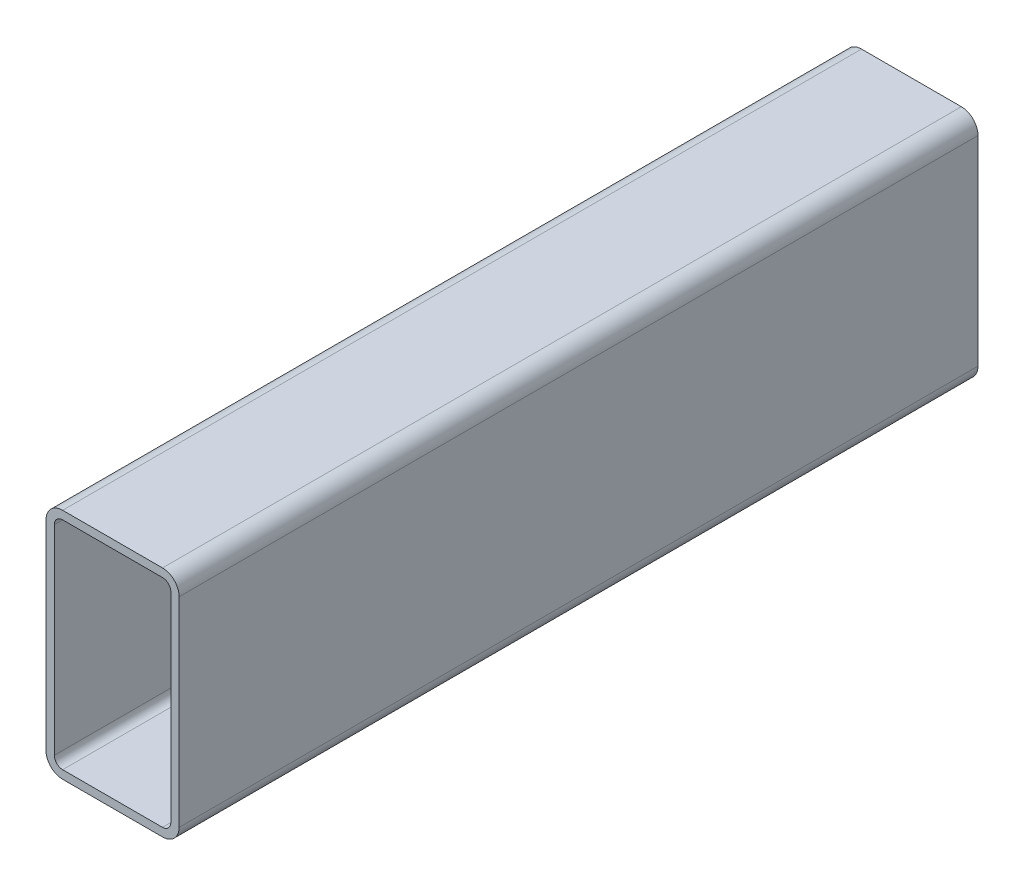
ISO-10303-21;
HEADER;
FILE_DESCRIPTION(('STEP AP214'),'2;1');
FILE_NAME('part.step','',(''),(''),'','','');
FILE_SCHEMA(('AUTOMOTIVE_DESIGN { 1 0 10303 214 1 1 1 1 }'));
ENDSEC;
DATA;
#1=APPLICATION_CONTEXT('core data for automotive mechanical design processes');
#2=APPLICATION_PROTOCOL_DEFINITION('international standard','automotive_design',2000,#1);
#3=PRODUCT_CONTEXT('',#1,'mechanical');
#4=PRODUCT('Part','Part','',(#3));
#5=PRODUCT_RELATED_PRODUCT_CATEGORY('part','',(#4));
#6=PRODUCT_DEFINITION_FORMATION('','',#4);
#7=PRODUCT_DEFINITION_CONTEXT('part definition',#1,'design');
#8=PRODUCT_DEFINITION('design','',#6,#7);
#9=PRODUCT_DEFINITION_SHAPE('','',#8);
#10=(LENGTH_UNIT() NAMED_UNIT(*) SI_UNIT(.MILLI.,.METRE.));
#11=(NAMED_UNIT(*) PLANE_ANGLE_UNIT() SI_UNIT($,.RADIAN.));
#12=(NAMED_UNIT(*) SI_UNIT($,.STERADIAN.) SOLID_ANGLE_UNIT());
#13=UNCERTAINTY_MEASURE_WITH_UNIT(LENGTH_MEASURE(1.E-05),#10,'distance_accuracy_value','');
#14=(GEOMETRIC_REPRESENTATION_CONTEXT(3) GLOBAL_UNCERTAINTY_ASSIGNED_CONTEXT((#13)) GLOBAL_UNIT_ASSIGNED_CONTEXT((#10,
#11,#12)) REPRESENTATION_CONTEXT('',''));
#15=CARTESIAN_POINT('',(0.,0.,0.));
#16=DIRECTION('',(0.,0.,1.));
#17=DIRECTION('',(1.,0.,0.));
#18=AXIS2_PLACEMENT_3D('',#15,#16,#17);
#19=CARTESIAN_POINT('',(6.35,82.55,304.8));
#20=DIRECTION('',(0.,0.,1.));
#21=DIRECTION('',(1.,0.,0.));
#22=AXIS2_PLACEMENT_3D('',#19,#20,#21);
#23=PLANE('',#22);
#24=CARTESIAN_POINT('',(6.35,82.55,304.8));
#25=DIRECTION('',(0.,0.,1.));
#26=DIRECTION('',(1.,0.,0.));
#27=AXIS2_PLACEMENT_3D('',#24,#25,#26);
#28=CIRCLE('',#27,6.35);
#29=CARTESIAN_POINT('',(6.35,88.9,304.8));
#30=VERTEX_POINT('',#29);
#31=CARTESIAN_POINT('',(0.,82.55,304.8));
#32=VERTEX_POINT('',#31);
#33=EDGE_CURVE('E211',#30,#32,#28,.T.);
#34=ORIENTED_EDGE('',*,*,#33,.T.);
#35=DIRECTION('',(0.,-1.,0.));
#36=VECTOR('',#35,1.);
#37=CARTESIAN_POINT('',(0.,6.35,304.8));
#38=LINE('',#37,#36);
#39=CARTESIAN_POINT('',(0.,6.35,304.8));
#40=VERTEX_POINT('',#39);
#41=EDGE_CURVE('E214',#32,#40,#38,.T.);
#42=ORIENTED_EDGE('',*,*,#41,.T.);
#43=CARTESIAN_POINT('',(6.35,6.35,304.8));
#44=DIRECTION('',(0.,0.,1.));
#45=DIRECTION('',(1.,0.,0.));
#46=AXIS2_PLACEMENT_3D('',#43,#44,#45);
#47=CIRCLE('',#46,6.35);
#48=CARTESIAN_POINT('',(6.35,0.,304.8));
#49=VERTEX_POINT('',#48);
#50=EDGE_CURVE('E217',#40,#49,#47,.T.);
#51=ORIENTED_EDGE('',*,*,#50,.T.);
#52=DIRECTION('',(1.,0.,0.));
#53=VECTOR('',#52,1.);
#54=CARTESIAN_POINT('',(44.45,0.,304.8));
#55=LINE('',#54,#53);
#56=CARTESIAN_POINT('',(44.45,0.,304.8));
#57=VERTEX_POINT('',#56);
#58=EDGE_CURVE('E219',#49,#57,#55,.T.);
#59=ORIENTED_EDGE('',*,*,#58,.T.);
#60=CARTESIAN_POINT('',(44.45,6.35,304.8));
#61=DIRECTION('',(0.,0.,1.));
#62=DIRECTION('',(1.,0.,0.));
#63=AXIS2_PLACEMENT_3D('',#60,#61,#62);
#64=CIRCLE('',#63,6.35);
#65=CARTESIAN_POINT('',(50.8,6.35,304.8));
#66=VERTEX_POINT('',#65);
#67=EDGE_CURVE('E221',#57,#66,#64,.T.);
#68=ORIENTED_EDGE('',*,*,#67,.T.);
#69=DIRECTION('',(0.,1.,0.));
#70=VECTOR('',#69,1.);
#71=CARTESIAN_POINT('',(50.8,82.55,304.8));
#72=LINE('',#71,#70);
#73=CARTESIAN_POINT('',(50.8,82.55,304.8));
#74=VERTEX_POINT('',#73);
#75=EDGE_CURVE('E223',#66,#74,#72,.T.);
#76=ORIENTED_EDGE('',*,*,#75,.T.);
#77=CARTESIAN_POINT('',(44.45,82.55,304.8));
#78=DIRECTION('',(0.,0.,1.));
#79=DIRECTION('',(1.,0.,0.));
#80=AXIS2_PLACEMENT_3D('',#77,#78,#79);
#81=CIRCLE('',#80,6.35);
#82=CARTESIAN_POINT('',(44.45,88.9,304.8));
#83=VERTEX_POINT('',#82);
#84=EDGE_CURVE('E225',#74,#83,#81,.T.);
#85=ORIENTED_EDGE('',*,*,#84,.T.);
#86=DIRECTION('',(-1.,0.,0.));
#87=VECTOR('',#86,1.);
#88=CARTESIAN_POINT('',(6.35,88.9,304.8));
#89=LINE('',#88,#87);
#90=EDGE_CURVE('E227',#83,#30,#89,.T.);
#91=ORIENTED_EDGE('',*,*,#90,.T.);
#92=EDGE_LOOP('',(#34,#42,#51,#59,#68,#76,#85,#91));
#93=FACE_BOUND('',#92,.T.);
#94=DIRECTION('',(0.,-1.,0.));
#95=VECTOR('',#94,1.);
#96=CARTESIAN_POINT('',(3.175,6.35,304.8));
#97=LINE('',#96,#95);
#98=CARTESIAN_POINT('',(3.175,82.55,304.8));
#99=VERTEX_POINT('',#98);
#100=CARTESIAN_POINT('',(3.175,6.35,304.8));
#101=VERTEX_POINT('',#100);
#102=EDGE_CURVE('E154',#99,#101,#97,.T.);
#103=ORIENTED_EDGE('',*,*,#102,.F.);
#104=CARTESIAN_POINT('',(6.35,82.55,304.8));
#105=DIRECTION('',(0.,0.,1.));
#106=DIRECTION('',(1.,0.,0.));
#107=AXIS2_PLACEMENT_3D('',#104,#105,#106);
#108=CIRCLE('',#107,3.175);
#109=CARTESIAN_POINT('',(6.35,85.725,304.8));
#110=VERTEX_POINT('',#109);
#111=EDGE_CURVE('E146',#110,#99,#108,.T.);
#112=ORIENTED_EDGE('',*,*,#111,.F.);
#113=DIRECTION('',(-1.,0.,0.));
#114=VECTOR('',#113,1.);
#115=CARTESIAN_POINT('',(6.35,85.725,304.8));
#116=LINE('',#115,#114);
#117=CARTESIAN_POINT('',(44.45,85.725,304.8));
#118=VERTEX_POINT('',#117);
#119=EDGE_CURVE('E179',#118,#110,#116,.T.);
#120=ORIENTED_EDGE('',*,*,#119,.F.);
#121=CARTESIAN_POINT('',(44.45,82.55,304.8));
#122=DIRECTION('',(0.,0.,1.));
#123=DIRECTION('',(1.,0.,0.));
#124=AXIS2_PLACEMENT_3D('',#121,#122,#123);
#125=CIRCLE('',#124,3.175);
#126=CARTESIAN_POINT('',(47.625,82.55,304.8));
#127=VERTEX_POINT('',#126);
#128=EDGE_CURVE('E177',#127,#118,#125,.T.);
#129=ORIENTED_EDGE('',*,*,#128,.F.);
#130=DIRECTION('',(0.,1.,0.));
#131=VECTOR('',#130,1.);
#132=CARTESIAN_POINT('',(47.625,82.55,304.8));
#133=LINE('',#132,#131);
#134=CARTESIAN_POINT('',(47.625,6.35,304.8));
#135=VERTEX_POINT('',#134);
#136=EDGE_CURVE('E175',#135,#127,#133,.T.);
#137=ORIENTED_EDGE('',*,*,#136,.F.);
#138=CARTESIAN_POINT('',(44.45,6.35,304.8));
#139=DIRECTION('',(0.,0.,1.));
#140=DIRECTION('',(1.,0.,0.));
#141=AXIS2_PLACEMENT_3D('',#138,#139,#140);
#142=CIRCLE('',#141,3.175);
#143=CARTESIAN_POINT('',(44.45,3.175,304.8));
#144=VERTEX_POINT('',#143);
#145=EDGE_CURVE('E173',#144,#135,#142,.T.);
#146=ORIENTED_EDGE('',*,*,#145,.F.);
#147=DIRECTION('',(1.,0.,0.));
#148=VECTOR('',#147,1.);
#149=CARTESIAN_POINT('',(44.45,3.175,304.8));
#150=LINE('',#149,#148);
#151=CARTESIAN_POINT('',(6.35,3.175,304.8));
#152=VERTEX_POINT('',#151);
#153=EDGE_CURVE('E169',#152,#144,#150,.T.);
#154=ORIENTED_EDGE('',*,*,#153,.F.);
#155=CARTESIAN_POINT('',(6.35,6.35,304.8));
#156=DIRECTION('',(0.,0.,1.));
#157=DIRECTION('',(1.,0.,0.));
#158=AXIS2_PLACEMENT_3D('',#155,#156,#157);
#159=CIRCLE('',#158,3.175);
#160=EDGE_CURVE('E167',#101,#152,#159,.T.);
#161=ORIENTED_EDGE('',*,*,#160,.F.);
#162=EDGE_LOOP('',(#103,#112,#120,#129,#137,#146,#154,#161));
#163=FACE_BOUND('',#162,.T.);
#164=ADVANCED_FACE('F33',(#93,#163),#23,.T.);
#165=CARTESIAN_POINT('',(6.35,82.55,0.));
#166=DIRECTION('',(0.,0.,1.));
#167=DIRECTION('',(1.,0.,0.));
#168=AXIS2_PLACEMENT_3D('',#165,#166,#167);
#169=PLANE('',#168);
#170=CARTESIAN_POINT('',(6.35,82.55,0.));
#171=DIRECTION('',(0.,0.,1.));
#172=DIRECTION('',(1.,0.,0.));
#173=AXIS2_PLACEMENT_3D('',#170,#171,#172);
#174=CIRCLE('',#173,6.35);
#175=CARTESIAN_POINT('',(6.35,88.9,0.));
#176=VERTEX_POINT('',#175);
#177=CARTESIAN_POINT('',(0.,82.55,0.));
#178=VERTEX_POINT('',#177);
#179=EDGE_CURVE('E162',#176,#178,#174,.T.);
#180=ORIENTED_EDGE('',*,*,#179,.F.);
#181=DIRECTION('',(-1.,0.,0.));
#182=VECTOR('',#181,1.);
#183=CARTESIAN_POINT('',(6.35,88.9,0.));
#184=LINE('',#183,#182);
#185=CARTESIAN_POINT('',(44.45,88.9,0.));
#186=VERTEX_POINT('',#185);
#187=EDGE_CURVE('E215',#186,#176,#184,.T.);
#188=ORIENTED_EDGE('',*,*,#187,.F.);
#189=CARTESIAN_POINT('',(44.45,82.55,0.));
#190=DIRECTION('',(0.,0.,1.));
#191=DIRECTION('',(1.,0.,0.));
#192=AXIS2_PLACEMENT_3D('',#189,#190,#191);
#193=CIRCLE('',#192,6.35);
#194=CARTESIAN_POINT('',(50.8,82.55,0.));
#195=VERTEX_POINT('',#194);
#196=EDGE_CURVE('E242',#195,#186,#193,.T.);
#197=ORIENTED_EDGE('',*,*,#196,.F.);
#198=DIRECTION('',(0.,1.,0.));
#199=VECTOR('',#198,1.);
#200=CARTESIAN_POINT('',(50.8,82.55,0.));
#201=LINE('',#200,#199);
#202=CARTESIAN_POINT('',(50.8,6.35,0.));
#203=VERTEX_POINT('',#202);
#204=EDGE_CURVE('E240',#203,#195,#201,.T.);
#205=ORIENTED_EDGE('',*,*,#204,.F.);
#206=CARTESIAN_POINT('',(44.45,6.35,0.));
#207=DIRECTION('',(0.,0.,1.));
#208=DIRECTION('',(1.,0.,0.));
#209=AXIS2_PLACEMENT_3D('',#206,#207,#208);
#210=CIRCLE('',#209,6.35);
#211=CARTESIAN_POINT('',(44.45,0.,0.));
#212=VERTEX_POINT('',#211);
#213=EDGE_CURVE('E238',#212,#203,#210,.T.);
#214=ORIENTED_EDGE('',*,*,#213,.F.);
#215=DIRECTION('',(1.,0.,0.));
#216=VECTOR('',#215,1.);
#217=CARTESIAN_POINT('',(44.45,0.,0.));
#218=LINE('',#217,#216);
#219=CARTESIAN_POINT('',(6.35,0.,0.));
#220=VERTEX_POINT('',#219);
#221=EDGE_CURVE('E236',#220,#212,#218,.T.);
#222=ORIENTED_EDGE('',*,*,#221,.F.);
#223=CARTESIAN_POINT('',(6.35,6.35,0.));
#224=DIRECTION('',(0.,0.,1.));
#225=DIRECTION('',(1.,0.,0.));
#226=AXIS2_PLACEMENT_3D('',#223,#224,#225);
#227=CIRCLE('',#226,6.35);
#228=CARTESIAN_POINT('',(0.,6.35,0.));
#229=VERTEX_POINT('',#228);
#230=EDGE_CURVE('E234',#229,#220,#227,.T.);
#231=ORIENTED_EDGE('',*,*,#230,.F.);
#232=DIRECTION('',(0.,-1.,0.));
#233=VECTOR('',#232,1.);
#234=CARTESIAN_POINT('',(0.,6.35,0.));
#235=LINE('',#234,#233);
#236=EDGE_CURVE('E232',#178,#229,#235,.T.);
#237=ORIENTED_EDGE('',*,*,#236,.F.);
#238=EDGE_LOOP('',(#180,#188,#197,#205,#214,#222,#231,#237));
#239=FACE_BOUND('',#238,.T.);
#240=CARTESIAN_POINT('',(6.35,82.55,0.));
#241=DIRECTION('',(0.,0.,1.));
#242=DIRECTION('',(1.,0.,0.));
#243=AXIS2_PLACEMENT_3D('',#240,#241,#242);
#244=CIRCLE('',#243,3.175);
#245=CARTESIAN_POINT('',(6.35,85.725,0.));
#246=VERTEX_POINT('',#245);
#247=CARTESIAN_POINT('',(3.175,82.55,0.));
#248=VERTEX_POINT('',#247);
#249=EDGE_CURVE('E56',#246,#248,#244,.T.);
#250=ORIENTED_EDGE('',*,*,#249,.T.);
#251=DIRECTION('',(0.,-1.,0.));
#252=VECTOR('',#251,1.);
#253=CARTESIAN_POINT('',(3.175,6.35,0.));
#254=LINE('',#253,#252);
#255=CARTESIAN_POINT('',(3.175,6.35,0.));
#256=VERTEX_POINT('',#255);
#257=EDGE_CURVE('E161',#248,#256,#254,.T.);
#258=ORIENTED_EDGE('',*,*,#257,.T.);
#259=CARTESIAN_POINT('',(6.35,6.35,0.));
#260=DIRECTION('',(0.,0.,1.));
#261=DIRECTION('',(1.,0.,0.));
#262=AXIS2_PLACEMENT_3D('',#259,#260,#261);
#263=CIRCLE('',#262,3.175);
#264=CARTESIAN_POINT('',(6.35,3.175,0.));
#265=VERTEX_POINT('',#264);
#266=EDGE_CURVE('E183',#256,#265,#263,.T.);
#267=ORIENTED_EDGE('',*,*,#266,.T.);
#268=DIRECTION('',(1.,0.,0.));
#269=VECTOR('',#268,1.);
#270=CARTESIAN_POINT('',(44.45,3.175,0.));
#271=LINE('',#270,#269);
#272=CARTESIAN_POINT('',(44.45,3.175,0.));
#273=VERTEX_POINT('',#272);
#274=EDGE_CURVE('E186',#265,#273,#271,.T.);
#275=ORIENTED_EDGE('',*,*,#274,.T.);
#276=CARTESIAN_POINT('',(44.45,6.35,0.));
#277=DIRECTION('',(0.,0.,1.));
#278=DIRECTION('',(1.,0.,0.));
#279=AXIS2_PLACEMENT_3D('',#276,#277,#278);
#280=CIRCLE('',#279,3.175);
#281=CARTESIAN_POINT('',(47.625,6.35,0.));
#282=VERTEX_POINT('',#281);
#283=EDGE_CURVE('E189',#273,#282,#280,.T.);
#284=ORIENTED_EDGE('',*,*,#283,.T.);
#285=DIRECTION('',(0.,1.,0.));
#286=VECTOR('',#285,1.);
#287=CARTESIAN_POINT('',(47.625,82.55,0.));
#288=LINE('',#287,#286);
#289=CARTESIAN_POINT('',(47.625,82.55,0.));
#290=VERTEX_POINT('',#289);
#291=EDGE_CURVE('E192',#282,#290,#288,.T.);
#292=ORIENTED_EDGE('',*,*,#291,.T.);
#293=CARTESIAN_POINT('',(44.45,82.55,0.));
#294=DIRECTION('',(0.,0.,1.));
#295=DIRECTION('',(1.,0.,0.));
#296=AXIS2_PLACEMENT_3D('',#293,#294,#295);
#297=CIRCLE('',#296,3.175);
#298=CARTESIAN_POINT('',(44.45,85.725,0.));
#299=VERTEX_POINT('',#298);
#300=EDGE_CURVE('E195',#290,#299,#297,.T.);
#301=ORIENTED_EDGE('',*,*,#300,.T.);
#302=DIRECTION('',(-1.,0.,0.));
#303=VECTOR('',#302,1.);
#304=CARTESIAN_POINT('',(6.35,85.725,0.));
#305=LINE('',#304,#303);
#306=EDGE_CURVE('E155',#299,#246,#305,.T.);
#307=ORIENTED_EDGE('',*,*,#306,.T.);
#308=EDGE_LOOP('',(#250,#258,#267,#275,#284,#292,#301,#307));
#309=FACE_BOUND('',#308,.T.);
#310=ADVANCED_FACE('F272',(#239,#309),#169,.F.);
#311=CARTESIAN_POINT('',(6.35,82.55,304.8));
#312=DIRECTION('',(0.,0.,-1.));
#313=DIRECTION('',(-1.,0.,0.));
#314=AXIS2_PLACEMENT_3D('',#311,#312,#313);
#315=CYLINDRICAL_SURFACE('',#314,6.35);
#316=ORIENTED_EDGE('',*,*,#179,.T.);
#317=DIRECTION('',(0.,0.,-1.));
#318=VECTOR('',#317,1.);
#319=CARTESIAN_POINT('',(0.,82.55,304.8));
#320=LINE('',#319,#318);
#321=EDGE_CURVE('E11',#32,#178,#320,.T.);
#322=ORIENTED_EDGE('',*,*,#321,.F.);
#323=ORIENTED_EDGE('',*,*,#33,.F.);
#324=DIRECTION('',(0.,0.,-1.));
#325=VECTOR('',#324,1.);
#326=CARTESIAN_POINT('',(6.35,88.9,304.8));
#327=LINE('',#326,#325);
#328=EDGE_CURVE('E229',#30,#176,#327,.T.);
#329=ORIENTED_EDGE('',*,*,#328,.T.);
#330=EDGE_LOOP('',(#316,#322,#323,#329));
#331=FACE_BOUND('',#330,.T.);
#332=ADVANCED_FACE('F35',(#331),#315,.T.);
#333=CARTESIAN_POINT('',(0.,6.35,304.8));
#334=DIRECTION('',(1.,0.,0.));
#335=DIRECTION('',(0.,0.,-1.));
#336=AXIS2_PLACEMENT_3D('',#333,#334,#335);
#337=PLANE('',#336);
#338=ORIENTED_EDGE('',*,*,#236,.T.);
#339=DIRECTION('',(0.,0.,-1.));
#340=VECTOR('',#339,1.);
#341=CARTESIAN_POINT('',(0.,6.35,304.8));
#342=LINE('',#341,#340);
#343=EDGE_CURVE('E41',#40,#229,#342,.T.);
#344=ORIENTED_EDGE('',*,*,#343,.F.);
#345=ORIENTED_EDGE('',*,*,#41,.F.);
#346=ORIENTED_EDGE('',*,*,#321,.T.);
#347=EDGE_LOOP('',(#338,#344,#345,#346));
#348=FACE_BOUND('',#347,.T.);
#349=ADVANCED_FACE('F289',(#348),#337,.F.);
#350=CARTESIAN_POINT('',(6.35,6.35,304.8));
#351=DIRECTION('',(0.,0.,-1.));
#352=DIRECTION('',(-1.,0.,0.));
#353=AXIS2_PLACEMENT_3D('',#350,#351,#352);
#354=CYLINDRICAL_SURFACE('',#353,6.35);
#355=ORIENTED_EDGE('',*,*,#230,.T.);
#356=DIRECTION('',(0.,0.,-1.));
#357=VECTOR('',#356,1.);
#358=CARTESIAN_POINT('',(6.35,0.,304.8));
#359=LINE('',#358,#357);
#360=EDGE_CURVE('E259',#49,#220,#359,.T.);
#361=ORIENTED_EDGE('',*,*,#360,.F.);
#362=ORIENTED_EDGE('',*,*,#50,.F.);
#363=ORIENTED_EDGE('',*,*,#343,.T.);
#364=EDGE_LOOP('',(#355,#361,#362,#363));
#365=FACE_BOUND('',#364,.T.);
#366=ADVANCED_FACE('F266',(#365),#354,.T.);
#367=CARTESIAN_POINT('',(44.45,0.,304.8));
#368=DIRECTION('',(0.,1.,0.));
#369=DIRECTION('',(0.,0.,1.));
#370=AXIS2_PLACEMENT_3D('',#367,#368,#369);
#371=PLANE('',#370);
#372=ORIENTED_EDGE('',*,*,#221,.T.);
#373=DIRECTION('',(0.,0.,-1.));
#374=VECTOR('',#373,1.);
#375=CARTESIAN_POINT('',(44.45,0.,304.8));
#376=LINE('',#375,#374);
#377=EDGE_CURVE('E256',#57,#212,#376,.T.);
#378=ORIENTED_EDGE('',*,*,#377,.F.);
#379=ORIENTED_EDGE('',*,*,#58,.F.);
#380=ORIENTED_EDGE('',*,*,#360,.T.);
#381=EDGE_LOOP('',(#372,#378,#379,#380));
#382=FACE_BOUND('',#381,.T.);
#383=ADVANCED_FACE('F278',(#382),#371,.F.);
#384=CARTESIAN_POINT('',(44.45,6.35,304.8));
#385=DIRECTION('',(0.,0.,-1.));
#386=DIRECTION('',(-1.,0.,0.));
#387=AXIS2_PLACEMENT_3D('',#384,#385,#386);
#388=CYLINDRICAL_SURFACE('',#387,6.35);
#389=ORIENTED_EDGE('',*,*,#213,.T.);
#390=DIRECTION('',(0.,0.,-1.));
#391=VECTOR('',#390,1.);
#392=CARTESIAN_POINT('',(50.8,6.35,304.8));
#393=LINE('',#392,#391);
#394=EDGE_CURVE('E253',#66,#203,#393,.T.);
#395=ORIENTED_EDGE('',*,*,#394,.F.);
#396=ORIENTED_EDGE('',*,*,#67,.F.);
#397=ORIENTED_EDGE('',*,*,#377,.T.);
#398=EDGE_LOOP('',(#389,#395,#396,#397));
#399=FACE_BOUND('',#398,.T.);
#400=ADVANCED_FACE('F282',(#399),#388,.T.);
#401=CARTESIAN_POINT('',(50.8,82.55,304.8));
#402=DIRECTION('',(-1.,0.,0.));
#403=DIRECTION('',(0.,0.,1.));
#404=AXIS2_PLACEMENT_3D('',#401,#402,#403);
#405=PLANE('',#404);
#406=ORIENTED_EDGE('',*,*,#204,.T.);
#407=DIRECTION('',(0.,0.,-1.));
#408=VECTOR('',#407,1.);
#409=CARTESIAN_POINT('',(50.8,82.55,304.8));
#410=LINE('',#409,#408);
#411=EDGE_CURVE('E250',#74,#195,#410,.T.);
#412=ORIENTED_EDGE('',*,*,#411,.F.);
#413=ORIENTED_EDGE('',*,*,#75,.F.);
#414=ORIENTED_EDGE('',*,*,#394,.T.);
#415=EDGE_LOOP('',(#406,#412,#413,#414));
#416=FACE_BOUND('',#415,.T.);
#417=ADVANCED_FACE('F302',(#416),#405,.F.);
#418=CARTESIAN_POINT('',(44.45,82.55,304.8));
#419=DIRECTION('',(0.,0.,-1.));
#420=DIRECTION('',(-1.,0.,0.));
#421=AXIS2_PLACEMENT_3D('',#418,#419,#420);
#422=CYLINDRICAL_SURFACE('',#421,6.35);
#423=ORIENTED_EDGE('',*,*,#196,.T.);
#424=DIRECTION('',(0.,0.,-1.));
#425=VECTOR('',#424,1.);
#426=CARTESIAN_POINT('',(44.45,88.9,304.8));
#427=LINE('',#426,#425);
#428=EDGE_CURVE('E247',#83,#186,#427,.T.);
#429=ORIENTED_EDGE('',*,*,#428,.F.);
#430=ORIENTED_EDGE('',*,*,#84,.F.);
#431=ORIENTED_EDGE('',*,*,#411,.T.);
#432=EDGE_LOOP('',(#423,#429,#430,#431));
#433=FACE_BOUND('',#432,.T.);
#434=ADVANCED_FACE('F300',(#433),#422,.T.);
#435=CARTESIAN_POINT('',(6.35,88.9,304.8));
#436=DIRECTION('',(0.,-1.,0.));
#437=DIRECTION('',(0.,0.,-1.));
#438=AXIS2_PLACEMENT_3D('',#435,#436,#437);
#439=PLANE('',#438);
#440=ORIENTED_EDGE('',*,*,#187,.T.);
#441=ORIENTED_EDGE('',*,*,#328,.F.);
#442=ORIENTED_EDGE('',*,*,#90,.F.);
#443=ORIENTED_EDGE('',*,*,#428,.T.);
#444=EDGE_LOOP('',(#440,#441,#442,#443));
#445=FACE_BOUND('',#444,.T.);
#446=ADVANCED_FACE('F295',(#445),#439,.F.);
#447=CARTESIAN_POINT('',(6.35,82.55,304.8));
#448=DIRECTION('',(0.,0.,-1.));
#449=DIRECTION('',(-1.,0.,0.));
#450=AXIS2_PLACEMENT_3D('',#447,#448,#449);
#451=CYLINDRICAL_SURFACE('',#450,3.175);
#452=ORIENTED_EDGE('',*,*,#249,.F.);
#453=DIRECTION('',(0.,0.,-1.));
#454=VECTOR('',#453,1.);
#455=CARTESIAN_POINT('',(6.35,85.725,304.8));
#456=LINE('',#455,#454);
#457=EDGE_CURVE('E150',#110,#246,#456,.T.);
#458=ORIENTED_EDGE('',*,*,#457,.F.);
#459=ORIENTED_EDGE('',*,*,#111,.T.);
#460=DIRECTION('',(0.,0.,-1.));
#461=VECTOR('',#460,1.);
#462=CARTESIAN_POINT('',(3.175,82.55,304.8));
#463=LINE('',#462,#461);
#464=EDGE_CURVE('E149',#99,#248,#463,.T.);
#465=ORIENTED_EDGE('',*,*,#464,.T.);
#466=EDGE_LOOP('',(#452,#458,#459,#465));
#467=FACE_BOUND('',#466,.T.);
#468=ADVANCED_FACE('F148',(#467),#451,.F.);
#469=CARTESIAN_POINT('',(3.175,6.35,304.8));
#470=DIRECTION('',(1.,0.,0.));
#471=DIRECTION('',(0.,0.,-1.));
#472=AXIS2_PLACEMENT_3D('',#469,#470,#471);
#473=PLANE('',#472);
#474=ORIENTED_EDGE('',*,*,#257,.F.);
#475=ORIENTED_EDGE('',*,*,#464,.F.);
#476=ORIENTED_EDGE('',*,*,#102,.T.);
#477=DIRECTION('',(0.,0.,-1.));
#478=VECTOR('',#477,1.);
#479=CARTESIAN_POINT('',(3.175,6.35,304.8));
#480=LINE('',#479,#478);
#481=EDGE_CURVE('E163',#101,#256,#480,.T.);
#482=ORIENTED_EDGE('',*,*,#481,.T.);
#483=EDGE_LOOP('',(#474,#475,#476,#482));
#484=FACE_BOUND('',#483,.T.);
#485=ADVANCED_FACE('F158',(#484),#473,.T.);
#486=CARTESIAN_POINT('',(6.35,6.35,304.8));
#487=DIRECTION('',(0.,0.,-1.));
#488=DIRECTION('',(-1.,0.,0.));
#489=AXIS2_PLACEMENT_3D('',#486,#487,#488);
#490=CYLINDRICAL_SURFACE('',#489,3.175);
#491=ORIENTED_EDGE('',*,*,#266,.F.);
#492=ORIENTED_EDGE('',*,*,#481,.F.);
#493=ORIENTED_EDGE('',*,*,#160,.T.);
#494=DIRECTION('',(0.,0.,-1.));
#495=VECTOR('',#494,1.);
#496=CARTESIAN_POINT('',(6.35,3.175,304.8));
#497=LINE('',#496,#495);
#498=EDGE_CURVE('E208',#152,#265,#497,.T.);
#499=ORIENTED_EDGE('',*,*,#498,.T.);
#500=EDGE_LOOP('',(#491,#492,#493,#499));
#501=FACE_BOUND('',#500,.T.);
#502=ADVANCED_FACE('F327',(#501),#490,.F.);
#503=CARTESIAN_POINT('',(44.45,3.175,304.8));
#504=DIRECTION('',(0.,1.,0.));
#505=DIRECTION('',(0.,0.,1.));
#506=AXIS2_PLACEMENT_3D('',#503,#504,#505);
#507=PLANE('',#506);
#508=ORIENTED_EDGE('',*,*,#274,.F.);
#509=ORIENTED_EDGE('',*,*,#498,.F.);
#510=ORIENTED_EDGE('',*,*,#153,.T.);
#511=DIRECTION('',(0.,0.,-1.));
#512=VECTOR('',#511,1.);
#513=CARTESIAN_POINT('',(44.45,3.175,304.8));
#514=LINE('',#513,#512);
#515=EDGE_CURVE('E206',#144,#273,#514,.T.);
#516=ORIENTED_EDGE('',*,*,#515,.T.);
#517=EDGE_LOOP('',(#508,#509,#510,#516));
#518=FACE_BOUND('',#517,.T.);
#519=ADVANCED_FACE('F331',(#518),#507,.T.);
#520=CARTESIAN_POINT('',(44.45,6.35,304.8));
#521=DIRECTION('',(0.,0.,-1.));
#522=DIRECTION('',(-1.,0.,0.));
#523=AXIS2_PLACEMENT_3D('',#520,#521,#522);
#524=CYLINDRICAL_SURFACE('',#523,3.175);
#525=ORIENTED_EDGE('',*,*,#283,.F.);
#526=ORIENTED_EDGE('',*,*,#515,.F.);
#527=ORIENTED_EDGE('',*,*,#145,.T.);
#528=DIRECTION('',(0.,0.,-1.));
#529=VECTOR('',#528,1.);
#530=CARTESIAN_POINT('',(47.625,6.35,304.8));
#531=LINE('',#530,#529);
#532=EDGE_CURVE('E204',#135,#282,#531,.T.);
#533=ORIENTED_EDGE('',*,*,#532,.T.);
#534=EDGE_LOOP('',(#525,#526,#527,#533));
#535=FACE_BOUND('',#534,.T.);
#536=ADVANCED_FACE('F337',(#535),#524,.F.);
#537=CARTESIAN_POINT('',(47.625,82.55,304.8));
#538=DIRECTION('',(-1.,0.,0.));
#539=DIRECTION('',(0.,0.,1.));
#540=AXIS2_PLACEMENT_3D('',#537,#538,#539);
#541=PLANE('',#540);
#542=ORIENTED_EDGE('',*,*,#291,.F.);
#543=ORIENTED_EDGE('',*,*,#532,.F.);
#544=ORIENTED_EDGE('',*,*,#136,.T.);
#545=DIRECTION('',(0.,0.,-1.));
#546=VECTOR('',#545,1.);
#547=CARTESIAN_POINT('',(47.625,82.55,304.8));
#548=LINE('',#547,#546);
#549=EDGE_CURVE('E202',#127,#290,#548,.T.);
#550=ORIENTED_EDGE('',*,*,#549,.T.);
#551=EDGE_LOOP('',(#542,#543,#544,#550));
#552=FACE_BOUND('',#551,.T.);
#553=ADVANCED_FACE('F341',(#552),#541,.T.);
#554=CARTESIAN_POINT('',(44.45,82.55,304.8));
#555=DIRECTION('',(0.,0.,-1.));
#556=DIRECTION('',(-1.,0.,0.));
#557=AXIS2_PLACEMENT_3D('',#554,#555,#556);
#558=CYLINDRICAL_SURFACE('',#557,3.175);
#559=ORIENTED_EDGE('',*,*,#300,.F.);
#560=ORIENTED_EDGE('',*,*,#549,.F.);
#561=ORIENTED_EDGE('',*,*,#128,.T.);
#562=DIRECTION('',(0.,0.,-1.));
#563=VECTOR('',#562,1.);
#564=CARTESIAN_POINT('',(44.45,85.725,304.8));
#565=LINE('',#564,#563);
#566=EDGE_CURVE('E48',#118,#299,#565,.T.);
#567=ORIENTED_EDGE('',*,*,#566,.T.);
#568=EDGE_LOOP('',(#559,#560,#561,#567));
#569=FACE_BOUND('',#568,.T.);
#570=ADVANCED_FACE('F345',(#569),#558,.F.);
#571=CARTESIAN_POINT('',(6.35,85.725,304.8));
#572=DIRECTION('',(0.,-1.,0.));
#573=DIRECTION('',(0.,0.,-1.));
#574=AXIS2_PLACEMENT_3D('',#571,#572,#573);
#575=PLANE('',#574);
#576=ORIENTED_EDGE('',*,*,#306,.F.);
#577=ORIENTED_EDGE('',*,*,#566,.F.);
#578=ORIENTED_EDGE('',*,*,#119,.T.);
#579=ORIENTED_EDGE('',*,*,#457,.T.);
#580=EDGE_LOOP('',(#576,#577,#578,#579));
#581=FACE_BOUND('',#580,.T.);
#582=ADVANCED_FACE('F349',(#581),#575,.T.);
#583=CLOSED_SHELL('',(#164,#310,#332,#349,#366,#383,#400,#417,#434,#446,#468,#485,#502,#519,
#536,#553,#570,#582));
#584=MANIFOLD_SOLID_BREP('B2',#583);
#585=ADVANCED_BREP_SHAPE_REPRESENTATION('',(#18,#584),#14);
#586=SHAPE_DEFINITION_REPRESENTATION(#9,#585);
ENDSEC;
END-ISO-10303-21;
